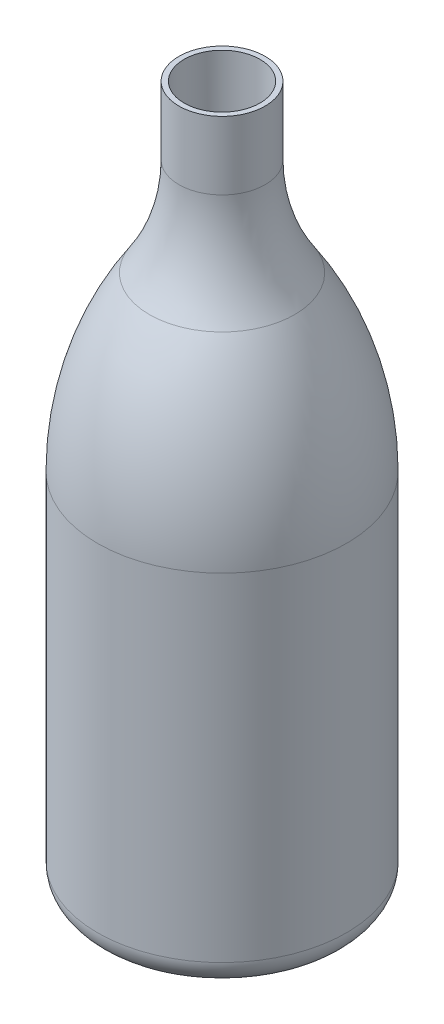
ISO-10303-21;
HEADER;
FILE_DESCRIPTION(('STEP AP214'),'2;1');
FILE_NAME('part.step','',(''),(''),'','','');
FILE_SCHEMA(('AUTOMOTIVE_DESIGN { 1 0 10303 214 1 1 1 1 }'));
ENDSEC;
DATA;
#1=APPLICATION_CONTEXT('core data for automotive mechanical design processes');
#2=APPLICATION_PROTOCOL_DEFINITION('international standard','automotive_design',2000,#1);
#3=PRODUCT_CONTEXT('',#1,'mechanical');
#4=PRODUCT('Part','Part','',(#3));
#5=PRODUCT_RELATED_PRODUCT_CATEGORY('part','',(#4));
#6=PRODUCT_DEFINITION_FORMATION('','',#4);
#7=PRODUCT_DEFINITION_CONTEXT('part definition',#1,'design');
#8=PRODUCT_DEFINITION('design','',#6,#7);
#9=PRODUCT_DEFINITION_SHAPE('','',#8);
#10=(LENGTH_UNIT() NAMED_UNIT(*) SI_UNIT(.MILLI.,.METRE.));
#11=(NAMED_UNIT(*) PLANE_ANGLE_UNIT() SI_UNIT($,.RADIAN.));
#12=(NAMED_UNIT(*) SI_UNIT($,.STERADIAN.) SOLID_ANGLE_UNIT());
#13=UNCERTAINTY_MEASURE_WITH_UNIT(LENGTH_MEASURE(1.E-05),#10,'distance_accuracy_value','');
#14=(GEOMETRIC_REPRESENTATION_CONTEXT(3) GLOBAL_UNCERTAINTY_ASSIGNED_CONTEXT((#13)) GLOBAL_UNIT_ASSIGNED_CONTEXT((#10,
#11,#12)) REPRESENTATION_CONTEXT('',''));
#15=CARTESIAN_POINT('',(0.,0.,0.));
#16=DIRECTION('',(0.,0.,1.));
#17=DIRECTION('',(1.,0.,0.));
#18=AXIS2_PLACEMENT_3D('',#15,#16,#17);
#19=CARTESIAN_POINT('',(8.34146611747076,135.663330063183,0.));
#20=DIRECTION('',(0.,-1.,0.));
#21=DIRECTION('',(0.,0.,-1.));
#22=AXIS2_PLACEMENT_3D('',#19,#20,#21);
#23=PLANE('',#22);
#24=CARTESIAN_POINT('',(0.,135.663330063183,0.));
#25=DIRECTION('',(0.,1.,0.));
#26=DIRECTION('',(0.,0.,1.));
#27=AXIS2_PLACEMENT_3D('',#24,#25,#26);
#28=CIRCLE('',#27,8.34146611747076);
#29=CARTESIAN_POINT('',(0.,135.663330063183,8.34146611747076));
#30=VERTEX_POINT('',#29);
#31=EDGE_CURVE('E52',#30,#30,#28,.T.);
#32=ORIENTED_EDGE('',*,*,#31,.T.);
#33=EDGE_LOOP('',(#32));
#34=FACE_BOUND('',#33,.T.);
#35=CARTESIAN_POINT('',(0.,135.663330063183,0.));
#36=DIRECTION('',(0.,-1.,0.));
#37=DIRECTION('',(0.,0.,-1.));
#38=AXIS2_PLACEMENT_3D('',#35,#36,#37);
#39=CIRCLE('',#38,7.34146611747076);
#40=CARTESIAN_POINT('',(0.,135.663330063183,-7.34146611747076));
#41=VERTEX_POINT('',#40);
#42=EDGE_CURVE('E56',#41,#41,#39,.F.);
#43=ORIENTED_EDGE('',*,*,#42,.F.);
#44=EDGE_LOOP('',(#43));
#45=FACE_BOUND('',#44,.T.);
#46=ADVANCED_FACE('F29',(#34,#45),#23,.F.);
#47=CARTESIAN_POINT('',(0.,0.,0.));
#48=DIRECTION('',(0.,1.,0.));
#49=DIRECTION('',(0.,0.,1.));
#50=AXIS2_PLACEMENT_3D('',#47,#48,#49);
#51=PLANE('',#50);
#52=CARTESIAN_POINT('',(0.,0.,0.));
#53=DIRECTION('',(0.,1.,0.));
#54=DIRECTION('',(0.,0.,1.));
#55=AXIS2_PLACEMENT_3D('',#52,#53,#54);
#56=CIRCLE('',#55,19.0891297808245);
#57=CARTESIAN_POINT('',(0.,0.,19.0891297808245));
#58=VERTEX_POINT('',#57);
#59=EDGE_CURVE('E10',#58,#58,#56,.F.);
#60=ORIENTED_EDGE('',*,*,#59,.T.);
#61=EDGE_LOOP('',(#60));
#62=FACE_BOUND('',#61,.T.);
#63=ADVANCED_FACE('F31',(#62),#51,.F.);
#64=CARTESIAN_POINT('',(0.,135.663330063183,0.));
#65=DIRECTION('',(0.,1.,0.));
#66=DIRECTION('',(0.,0.,1.));
#67=AXIS2_PLACEMENT_3D('',#64,#65,#66);
#68=CYLINDRICAL_SURFACE('',#67,24.0891297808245);
#69=CARTESIAN_POINT('',(0.,5.,0.));
#70=DIRECTION('',(0.,1.,0.));
#71=DIRECTION('',(0.,0.,1.));
#72=AXIS2_PLACEMENT_3D('',#69,#70,#71);
#73=CIRCLE('',#72,24.0891297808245);
#74=CARTESIAN_POINT('',(0.,5.,24.0891297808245));
#75=VERTEX_POINT('',#74);
#76=EDGE_CURVE('E36',#75,#75,#73,.T.);
#77=ORIENTED_EDGE('',*,*,#76,.T.);
#78=EDGE_LOOP('',(#77));
#79=FACE_BOUND('',#78,.T.);
#80=CARTESIAN_POINT('',(0.,70.2527777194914,0.));
#81=DIRECTION('',(0.,1.,0.));
#82=DIRECTION('',(0.,0.,1.));
#83=AXIS2_PLACEMENT_3D('',#80,#81,#82);
#84=CIRCLE('',#83,24.0891297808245);
#85=CARTESIAN_POINT('',(0.,70.2527777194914,24.0891297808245));
#86=VERTEX_POINT('',#85);
#87=EDGE_CURVE('E40',#86,#86,#84,.T.);
#88=ORIENTED_EDGE('',*,*,#87,.F.);
#89=EDGE_LOOP('',(#88));
#90=FACE_BOUND('',#89,.T.);
#91=ADVANCED_FACE('F98',(#79,#90),#68,.T.);
#92=CARTESIAN_POINT('',(0.,70.2527777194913,0.));
#93=DIRECTION('',(0.,1.,0.));
#94=DIRECTION('',(0.,0.,1.));
#95=AXIS2_PLACEMENT_3D('',#92,#93,#94);
#96=DEGENERATE_TOROIDAL_SURFACE('',#95,36.1854695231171,60.2745993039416,.F.);
#97=CARTESIAN_POINT('',(0.,103.564670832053,0.));
#98=DIRECTION('',(0.,1.,0.));
#99=DIRECTION('',(0.,0.,1.));
#100=AXIS2_PLACEMENT_3D('',#97,#98,#99);
#101=CIRCLE('',#100,14.04743899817);
#102=CARTESIAN_POINT('',(0.,103.564670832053,14.04743899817));
#103=VERTEX_POINT('',#102);
#104=EDGE_CURVE('E44',#103,#103,#101,.T.);
#105=ORIENTED_EDGE('',*,*,#104,.F.);
#106=EDGE_LOOP('',(#105));
#107=FACE_BOUND('',#106,.T.);
#108=ORIENTED_EDGE('',*,*,#87,.T.);
#109=EDGE_LOOP('',(#108));
#110=FACE_BOUND('',#109,.T.);
#111=ADVANCED_FACE('F108',(#107,#110),#96,.F.);
#112=CARTESIAN_POINT('',(0.,122.493431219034,0.));
#113=DIRECTION('',(0.,1.,0.));
#114=DIRECTION('',(0.,0.,1.));
#115=AXIS2_PLACEMENT_3D('',#112,#113,#114);
#116=TOROIDAL_SURFACE('',#115,42.5911992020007,34.24973308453);
#117=CARTESIAN_POINT('',(0.,122.493431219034,0.));
#118=DIRECTION('',(0.,1.,0.));
#119=DIRECTION('',(0.,0.,1.));
#120=AXIS2_PLACEMENT_3D('',#117,#118,#119);
#121=CIRCLE('',#120,8.34146611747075);
#122=CARTESIAN_POINT('',(0.,122.493431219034,8.34146611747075));
#123=VERTEX_POINT('',#122);
#124=EDGE_CURVE('E49',#123,#123,#121,.T.);
#125=ORIENTED_EDGE('',*,*,#124,.F.);
#126=EDGE_LOOP('',(#125));
#127=FACE_BOUND('',#126,.T.);
#128=ORIENTED_EDGE('',*,*,#104,.T.);
#129=EDGE_LOOP('',(#128));
#130=FACE_BOUND('',#129,.T.);
#131=ADVANCED_FACE('F104',(#127,#130),#116,.F.);
#132=CARTESIAN_POINT('',(0.,135.663330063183,0.));
#133=DIRECTION('',(0.,1.,0.));
#134=DIRECTION('',(0.,0.,1.));
#135=AXIS2_PLACEMENT_3D('',#132,#133,#134);
#136=CYLINDRICAL_SURFACE('',#135,8.34146611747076);
#137=ORIENTED_EDGE('',*,*,#31,.F.);
#138=EDGE_LOOP('',(#137));
#139=FACE_BOUND('',#138,.T.);
#140=ORIENTED_EDGE('',*,*,#124,.T.);
#141=EDGE_LOOP('',(#140));
#142=FACE_BOUND('',#141,.T.);
#143=ADVANCED_FACE('F89',(#139,#142),#136,.T.);
#144=CARTESIAN_POINT('',(0.,5.,0.));
#145=DIRECTION('',(0.,1.,0.));
#146=DIRECTION('',(0.,0.,1.));
#147=AXIS2_PLACEMENT_3D('',#144,#145,#146);
#148=TOROIDAL_SURFACE('',#147,19.0891297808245,5.);
#149=ORIENTED_EDGE('',*,*,#59,.F.);
#150=EDGE_LOOP('',(#149));
#151=FACE_BOUND('',#150,.T.);
#152=ORIENTED_EDGE('',*,*,#76,.F.);
#153=EDGE_LOOP('',(#152));
#154=FACE_BOUND('',#153,.T.);
#155=ADVANCED_FACE('F80',(#151,#154),#148,.T.);
#156=CARTESIAN_POINT('',(0.,1.,0.));
#157=DIRECTION('',(0.,1.,0.));
#158=DIRECTION('',(0.,0.,1.));
#159=AXIS2_PLACEMENT_3D('',#156,#157,#158);
#160=PLANE('',#159);
#161=CARTESIAN_POINT('',(0.,1.,0.));
#162=DIRECTION('',(0.,1.,0.));
#163=DIRECTION('',(0.,0.,1.));
#164=AXIS2_PLACEMENT_3D('',#161,#162,#163);
#165=CIRCLE('',#164,19.0891297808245);
#166=CARTESIAN_POINT('',(0.,1.,19.0891297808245));
#167=VERTEX_POINT('',#166);
#168=EDGE_CURVE('E55',#167,#167,#165,.F.);
#169=ORIENTED_EDGE('',*,*,#168,.F.);
#170=EDGE_LOOP('',(#169));
#171=FACE_BOUND('',#170,.T.);
#172=ADVANCED_FACE('F77',(#171),#160,.T.);
#173=CARTESIAN_POINT('',(0.,135.663330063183,0.));
#174=DIRECTION('',(0.,1.,0.));
#175=DIRECTION('',(0.,0.,1.));
#176=AXIS2_PLACEMENT_3D('',#173,#174,#175);
#177=CYLINDRICAL_SURFACE('',#176,23.0891297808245);
#178=CARTESIAN_POINT('',(0.,5.,0.));
#179=DIRECTION('',(0.,1.,0.));
#180=DIRECTION('',(0.,0.,1.));
#181=AXIS2_PLACEMENT_3D('',#178,#179,#180);
#182=CIRCLE('',#181,23.0891297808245);
#183=CARTESIAN_POINT('',(0.,5.,23.0891297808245));
#184=VERTEX_POINT('',#183);
#185=EDGE_CURVE('E68',#184,#184,#182,.T.);
#186=ORIENTED_EDGE('',*,*,#185,.F.);
#187=EDGE_LOOP('',(#186));
#188=FACE_BOUND('',#187,.T.);
#189=CARTESIAN_POINT('',(0.,70.2527777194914,0.));
#190=DIRECTION('',(0.,1.,0.));
#191=DIRECTION('',(0.,0.,1.));
#192=AXIS2_PLACEMENT_3D('',#189,#190,#191);
#193=CIRCLE('',#192,23.0891297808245);
#194=CARTESIAN_POINT('',(0.,70.2527777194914,23.0891297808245));
#195=VERTEX_POINT('',#194);
#196=EDGE_CURVE('E65',#195,#195,#193,.T.);
#197=ORIENTED_EDGE('',*,*,#196,.T.);
#198=EDGE_LOOP('',(#197));
#199=FACE_BOUND('',#198,.T.);
#200=ADVANCED_FACE('F79',(#188,#199),#177,.F.);
#201=CARTESIAN_POINT('',(0.,70.2527777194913,0.));
#202=DIRECTION('',(0.,1.,0.));
#203=DIRECTION('',(0.,0.,1.));
#204=AXIS2_PLACEMENT_3D('',#201,#202,#203);
#205=DEGENERATE_TOROIDAL_SURFACE('',#204,36.1854695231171,59.2745993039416,.F.);
#206=CARTESIAN_POINT('',(0.,103.012001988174,0.));
#207=DIRECTION('',(0.,1.,0.));
#208=DIRECTION('',(0.,0.,1.));
#209=AXIS2_PLACEMENT_3D('',#206,#207,#208);
#210=CIRCLE('',#209,13.2140380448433);
#211=CARTESIAN_POINT('',(0.,103.012001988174,13.2140380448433));
#212=VERTEX_POINT('',#211);
#213=EDGE_CURVE('E62',#212,#212,#210,.T.);
#214=ORIENTED_EDGE('',*,*,#213,.T.);
#215=EDGE_LOOP('',(#214));
#216=FACE_BOUND('',#215,.T.);
#217=ORIENTED_EDGE('',*,*,#196,.F.);
#218=EDGE_LOOP('',(#217));
#219=FACE_BOUND('',#218,.T.);
#220=ADVANCED_FACE('F86',(#216,#219),#205,.T.);
#221=CARTESIAN_POINT('',(0.,122.493431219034,0.));
#222=DIRECTION('',(0.,1.,0.));
#223=DIRECTION('',(0.,0.,1.));
#224=AXIS2_PLACEMENT_3D('',#221,#222,#223);
#225=TOROIDAL_SURFACE('',#224,42.5911992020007,35.24973308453);
#226=CARTESIAN_POINT('',(0.,122.493431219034,0.));
#227=DIRECTION('',(0.,1.,0.));
#228=DIRECTION('',(0.,0.,1.));
#229=AXIS2_PLACEMENT_3D('',#226,#227,#228);
#230=CIRCLE('',#229,7.34146611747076);
#231=CARTESIAN_POINT('',(0.,122.493431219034,7.34146611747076));
#232=VERTEX_POINT('',#231);
#233=EDGE_CURVE('E59',#232,#232,#230,.T.);
#234=ORIENTED_EDGE('',*,*,#233,.T.);
#235=EDGE_LOOP('',(#234));
#236=FACE_BOUND('',#235,.T.);
#237=ORIENTED_EDGE('',*,*,#213,.F.);
#238=EDGE_LOOP('',(#237));
#239=FACE_BOUND('',#238,.T.);
#240=ADVANCED_FACE('F159',(#236,#239),#225,.T.);
#241=CARTESIAN_POINT('',(0.,135.663330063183,0.));
#242=DIRECTION('',(0.,1.,0.));
#243=DIRECTION('',(0.,0.,1.));
#244=AXIS2_PLACEMENT_3D('',#241,#242,#243);
#245=CYLINDRICAL_SURFACE('',#244,7.34146611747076);
#246=ORIENTED_EDGE('',*,*,#42,.T.);
#247=EDGE_LOOP('',(#246));
#248=FACE_BOUND('',#247,.T.);
#249=ORIENTED_EDGE('',*,*,#233,.F.);
#250=EDGE_LOOP('',(#249));
#251=FACE_BOUND('',#250,.T.);
#252=ADVANCED_FACE('F169',(#248,#251),#245,.F.);
#253=CARTESIAN_POINT('',(0.,5.,0.));
#254=DIRECTION('',(0.,1.,0.));
#255=DIRECTION('',(0.,0.,1.));
#256=AXIS2_PLACEMENT_3D('',#253,#254,#255);
#257=TOROIDAL_SURFACE('',#256,19.0891297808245,4.);
#258=ORIENTED_EDGE('',*,*,#168,.T.);
#259=EDGE_LOOP('',(#258));
#260=FACE_BOUND('',#259,.T.);
#261=ORIENTED_EDGE('',*,*,#185,.T.);
#262=EDGE_LOOP('',(#261));
#263=FACE_BOUND('',#262,.T.);
#264=ADVANCED_FACE('F74',(#260,#263),#257,.F.);
#265=CLOSED_SHELL('',(#46,#63,#91,#111,#131,#143,#155,#172,#200,#220,#240,#252,#264));
#266=MANIFOLD_SOLID_BREP('B2',#265);
#267=ADVANCED_BREP_SHAPE_REPRESENTATION('',(#18,#266),#14);
#268=SHAPE_DEFINITION_REPRESENTATION(#9,#267);
ENDSEC;
END-ISO-10303-21;
